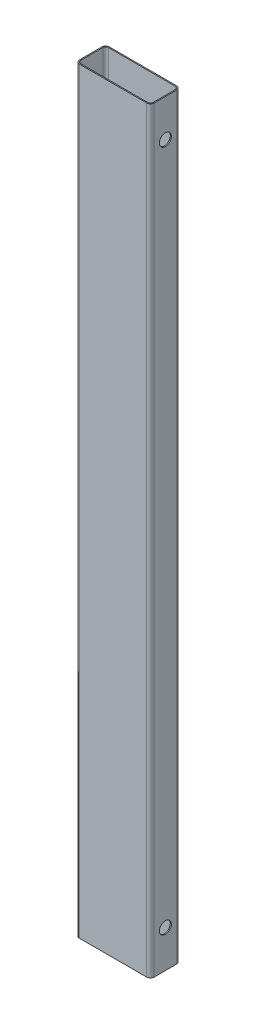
ISO-10303-21;
HEADER;
FILE_DESCRIPTION(('STEP AP214'),'2;1');
FILE_NAME('part.step','',(''),(''),'','','');
FILE_SCHEMA(('AUTOMOTIVE_DESIGN { 1 0 10303 214 1 1 1 1 }'));
ENDSEC;
DATA;
#1=APPLICATION_CONTEXT('core data for automotive mechanical design processes');
#2=APPLICATION_PROTOCOL_DEFINITION('international standard','automotive_design',2000,#1);
#3=PRODUCT_CONTEXT('',#1,'mechanical');
#4=PRODUCT('Part','Part','',(#3));
#5=PRODUCT_RELATED_PRODUCT_CATEGORY('part','',(#4));
#6=PRODUCT_DEFINITION_FORMATION('','',#4);
#7=PRODUCT_DEFINITION_CONTEXT('part definition',#1,'design');
#8=PRODUCT_DEFINITION('design','',#6,#7);
#9=PRODUCT_DEFINITION_SHAPE('','',#8);
#10=(LENGTH_UNIT() NAMED_UNIT(*) SI_UNIT(.MILLI.,.METRE.));
#11=(NAMED_UNIT(*) PLANE_ANGLE_UNIT() SI_UNIT($,.RADIAN.));
#12=(NAMED_UNIT(*) SI_UNIT($,.STERADIAN.) SOLID_ANGLE_UNIT());
#13=UNCERTAINTY_MEASURE_WITH_UNIT(LENGTH_MEASURE(1.E-05),#10,'distance_accuracy_value','');
#14=(GEOMETRIC_REPRESENTATION_CONTEXT(3) GLOBAL_UNCERTAINTY_ASSIGNED_CONTEXT((#13)) GLOBAL_UNIT_ASSIGNED_CONTEXT((#10,
#11,#12)) REPRESENTATION_CONTEXT('',''));
#15=CARTESIAN_POINT('',(0.,0.,0.));
#16=DIRECTION('',(0.,0.,1.));
#17=DIRECTION('',(1.,0.,0.));
#18=AXIS2_PLACEMENT_3D('',#15,#16,#17);
#19=CARTESIAN_POINT('',(-24.255,25.,0.));
#20=DIRECTION('',(-1.,0.,0.));
#21=DIRECTION('',(0.,-1.,0.));
#22=AXIS2_PLACEMENT_3D('',#19,#20,#21);
#23=CYLINDRICAL_SURFACE('',#22,4.);
#24=CARTESIAN_POINT('',(-24.325,25.,0.));
#25=DIRECTION('',(-1.,0.,0.));
#26=DIRECTION('',(0.,-1.,0.));
#27=AXIS2_PLACEMENT_3D('',#24,#25,#26);
#28=CIRCLE('',#27,4.);
#29=CARTESIAN_POINT('',(-24.325,21.,0.));
#30=VERTEX_POINT('',#29);
#31=EDGE_CURVE('E300',#30,#30,#28,.T.);
#32=ORIENTED_EDGE('',*,*,#31,.F.);
#33=EDGE_LOOP('',(#32));
#34=FACE_BOUND('',#33,.T.);
#35=CARTESIAN_POINT('',(-25.025,25.,0.));
#36=DIRECTION('',(-1.,0.,0.));
#37=DIRECTION('',(0.,-1.,0.));
#38=AXIS2_PLACEMENT_3D('',#35,#36,#37);
#39=CIRCLE('',#38,4.);
#40=CARTESIAN_POINT('',(-25.025,21.,0.));
#41=VERTEX_POINT('',#40);
#42=EDGE_CURVE('E21',#41,#41,#39,.T.);
#43=ORIENTED_EDGE('',*,*,#42,.T.);
#44=EDGE_LOOP('',(#43));
#45=FACE_BOUND('',#44,.T.);
#46=ADVANCED_FACE('F17',(#34,#45),#23,.F.);
#47=CARTESIAN_POINT('',(-24.255,482.,0.));
#48=DIRECTION('',(-1.,0.,0.));
#49=DIRECTION('',(0.,-1.,0.));
#50=AXIS2_PLACEMENT_3D('',#47,#48,#49);
#51=CYLINDRICAL_SURFACE('',#50,4.);
#52=CARTESIAN_POINT('',(-24.325,482.,0.));
#53=DIRECTION('',(-1.,0.,0.));
#54=DIRECTION('',(0.,-1.,0.));
#55=AXIS2_PLACEMENT_3D('',#52,#53,#54);
#56=CIRCLE('',#55,4.);
#57=CARTESIAN_POINT('',(-24.325,478.,0.));
#58=VERTEX_POINT('',#57);
#59=EDGE_CURVE('E296',#58,#58,#56,.T.);
#60=ORIENTED_EDGE('',*,*,#59,.F.);
#61=EDGE_LOOP('',(#60));
#62=FACE_BOUND('',#61,.T.);
#63=CARTESIAN_POINT('',(-25.025,482.,0.));
#64=DIRECTION('',(-1.,0.,0.));
#65=DIRECTION('',(0.,-1.,0.));
#66=AXIS2_PLACEMENT_3D('',#63,#64,#65);
#67=CIRCLE('',#66,4.);
#68=CARTESIAN_POINT('',(-25.025,478.,0.));
#69=VERTEX_POINT('',#68);
#70=EDGE_CURVE('E188',#69,#69,#67,.T.);
#71=ORIENTED_EDGE('',*,*,#70,.T.);
#72=EDGE_LOOP('',(#71));
#73=FACE_BOUND('',#72,.T.);
#74=ADVANCED_FACE('F705',(#62,#73),#51,.F.);
#75=CARTESIAN_POINT('',(7.50000000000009,447.,-9.255));
#76=DIRECTION('',(0.,0.,-1.));
#77=DIRECTION('',(0.,1.,0.));
#78=AXIS2_PLACEMENT_3D('',#75,#76,#77);
#79=CYLINDRICAL_SURFACE('',#78,4.99999999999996);
#80=DIRECTION('',(0.,0.,-1.));
#81=VECTOR('',#80,1.);
#82=CARTESIAN_POINT('',(12.5,447.,-9.675));
#83=LINE('',#82,#81);
#84=CARTESIAN_POINT('',(12.49999999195,447.,-9.325));
#85=VERTEX_POINT('',#84);
#86=CARTESIAN_POINT('',(12.49999999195,447.,-10.025));
#87=VERTEX_POINT('',#86);
#88=EDGE_CURVE('E198',#85,#87,#83,.T.);
#89=ORIENTED_EDGE('',*,*,#88,.T.);
#90=CARTESIAN_POINT('',(7.5000000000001,447.,-10.025));
#91=DIRECTION('',(0.,0.,-1.));
#92=DIRECTION('',(0.,1.,0.));
#93=AXIS2_PLACEMENT_3D('',#90,#91,#92);
#94=CIRCLE('',#93,4.99999999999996);
#95=CARTESIAN_POINT('',(7.50000000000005,442.000000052,-10.025));
#96=VERTEX_POINT('',#95);
#97=EDGE_CURVE('E304',#87,#96,#94,.T.);
#98=ORIENTED_EDGE('',*,*,#97,.T.);
#99=DIRECTION('',(0.,0.,1.));
#100=VECTOR('',#99,1.);
#101=CARTESIAN_POINT('',(7.5,442.,-9.675));
#102=LINE('',#101,#100);
#103=CARTESIAN_POINT('',(7.50000000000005,442.000000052,-9.325));
#104=VERTEX_POINT('',#103);
#105=EDGE_CURVE('E214',#96,#104,#102,.T.);
#106=ORIENTED_EDGE('',*,*,#105,.T.);
#107=CARTESIAN_POINT('',(7.50000000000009,447.,-9.325));
#108=DIRECTION('',(0.,0.,-1.));
#109=DIRECTION('',(0.,1.,0.));
#110=AXIS2_PLACEMENT_3D('',#107,#108,#109);
#111=CIRCLE('',#110,4.99999999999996);
#112=EDGE_CURVE('E293',#85,#104,#111,.T.);
#113=ORIENTED_EDGE('',*,*,#112,.F.);
#114=EDGE_LOOP('',(#89,#98,#106,#113));
#115=FACE_BOUND('',#114,.T.);
#116=ADVANCED_FACE('F355',(#115),#79,.F.);
#117=CARTESIAN_POINT('',(-7.5,442.,-9.325));
#118=DIRECTION('',(0.,-1.,0.));
#119=DIRECTION('',(0.,0.,-1.));
#120=AXIS2_PLACEMENT_3D('',#117,#118,#119);
#121=PLANE('',#120);
#122=ORIENTED_EDGE('',*,*,#105,.F.);
#123=DIRECTION('',(-1.,0.,0.));
#124=VECTOR('',#123,1.);
#125=CARTESIAN_POINT('',(0.,442.000000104,-10.025));
#126=LINE('',#125,#124);
#127=CARTESIAN_POINT('',(-7.50000000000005,442.000000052,-10.025));
#128=VERTEX_POINT('',#127);
#129=EDGE_CURVE('E306',#96,#128,#126,.T.);
#130=ORIENTED_EDGE('',*,*,#129,.T.);
#131=DIRECTION('',(0.,0.,1.));
#132=VECTOR('',#131,1.);
#133=CARTESIAN_POINT('',(-7.5,442.,-9.675));
#134=LINE('',#133,#132);
#135=CARTESIAN_POINT('',(-7.50000000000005,442.000000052,-9.325));
#136=VERTEX_POINT('',#135);
#137=EDGE_CURVE('E153',#128,#136,#134,.T.);
#138=ORIENTED_EDGE('',*,*,#137,.T.);
#139=DIRECTION('',(-1.,0.,0.));
#140=VECTOR('',#139,1.);
#141=CARTESIAN_POINT('',(0.,442.000000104,-9.325));
#142=LINE('',#141,#140);
#143=EDGE_CURVE('E292',#104,#136,#142,.T.);
#144=ORIENTED_EDGE('',*,*,#143,.F.);
#145=EDGE_LOOP('',(#122,#130,#138,#144));
#146=FACE_BOUND('',#145,.T.);
#147=ADVANCED_FACE('F351',(#146),#121,.F.);
#148=CARTESIAN_POINT('',(-7.50000000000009,447.,-9.255));
#149=DIRECTION('',(0.,0.,-1.));
#150=DIRECTION('',(0.,1.,0.));
#151=AXIS2_PLACEMENT_3D('',#148,#149,#150);
#152=CYLINDRICAL_SURFACE('',#151,4.99999999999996);
#153=ORIENTED_EDGE('',*,*,#137,.F.);
#154=CARTESIAN_POINT('',(-7.5000000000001,447.,-10.025));
#155=DIRECTION('',(0.,0.,-1.));
#156=DIRECTION('',(0.,1.,0.));
#157=AXIS2_PLACEMENT_3D('',#154,#155,#156);
#158=CIRCLE('',#157,4.99999999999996);
#159=CARTESIAN_POINT('',(-12.49999999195,447.,-10.025));
#160=VERTEX_POINT('',#159);
#161=EDGE_CURVE('E174',#128,#160,#158,.T.);
#162=ORIENTED_EDGE('',*,*,#161,.T.);
#163=DIRECTION('',(0.,0.,1.));
#164=VECTOR('',#163,1.);
#165=CARTESIAN_POINT('',(-12.5,447.,-9.675));
#166=LINE('',#165,#164);
#167=CARTESIAN_POINT('',(-12.49999999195,447.,-9.325));
#168=VERTEX_POINT('',#167);
#169=EDGE_CURVE('E160',#160,#168,#166,.T.);
#170=ORIENTED_EDGE('',*,*,#169,.T.);
#171=CARTESIAN_POINT('',(-7.50000000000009,447.,-9.325));
#172=DIRECTION('',(0.,0.,-1.));
#173=DIRECTION('',(0.,1.,0.));
#174=AXIS2_PLACEMENT_3D('',#171,#172,#173);
#175=CIRCLE('',#174,4.99999999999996);
#176=EDGE_CURVE('E290',#136,#168,#175,.T.);
#177=ORIENTED_EDGE('',*,*,#176,.F.);
#178=EDGE_LOOP('',(#153,#162,#170,#177));
#179=FACE_BOUND('',#178,.T.);
#180=ADVANCED_FACE('F180',(#179),#152,.F.);
#181=CARTESIAN_POINT('',(-12.5,447.,-10.025));
#182=DIRECTION('',(-1.,0.,0.));
#183=DIRECTION('',(0.,0.,1.));
#184=AXIS2_PLACEMENT_3D('',#181,#182,#183);
#185=PLANE('',#184);
#186=ORIENTED_EDGE('',*,*,#169,.F.);
#187=DIRECTION('',(0.,1.,0.));
#188=VECTOR('',#187,1.);
#189=CARTESIAN_POINT('',(-12.4999999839,253.5,-10.025));
#190=LINE('',#189,#188);
#191=CARTESIAN_POINT('',(-12.49999999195,462.,-10.025));
#192=VERTEX_POINT('',#191);
#193=EDGE_CURVE('E164',#160,#192,#190,.T.);
#194=ORIENTED_EDGE('',*,*,#193,.T.);
#195=DIRECTION('',(0.,0.,1.));
#196=VECTOR('',#195,1.);
#197=CARTESIAN_POINT('',(-12.5,462.,-9.675));
#198=LINE('',#197,#196);
#199=CARTESIAN_POINT('',(-12.49999999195,462.,-9.325));
#200=VERTEX_POINT('',#199);
#201=EDGE_CURVE('E166',#192,#200,#198,.T.);
#202=ORIENTED_EDGE('',*,*,#201,.T.);
#203=DIRECTION('',(0.,1.,0.));
#204=VECTOR('',#203,1.);
#205=CARTESIAN_POINT('',(-12.4999999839,253.5,-9.325));
#206=LINE('',#205,#204);
#207=EDGE_CURVE('E165',#168,#200,#206,.T.);
#208=ORIENTED_EDGE('',*,*,#207,.F.);
#209=EDGE_LOOP('',(#186,#194,#202,#208));
#210=FACE_BOUND('',#209,.T.);
#211=ADVANCED_FACE('F162',(#210),#185,.F.);
#212=CARTESIAN_POINT('',(-7.5,462.,-9.255));
#213=DIRECTION('',(0.,0.,-1.));
#214=DIRECTION('',(0.,1.,0.));
#215=AXIS2_PLACEMENT_3D('',#212,#213,#214);
#216=CYLINDRICAL_SURFACE('',#215,5.);
#217=ORIENTED_EDGE('',*,*,#201,.F.);
#218=CARTESIAN_POINT('',(-7.5,462.,-10.025));
#219=DIRECTION('',(0.,0.,-1.));
#220=DIRECTION('',(0.,1.,0.));
#221=AXIS2_PLACEMENT_3D('',#218,#219,#220);
#222=CIRCLE('',#221,5.);
#223=CARTESIAN_POINT('',(-7.5,466.999999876,-10.025));
#224=VERTEX_POINT('',#223);
#225=EDGE_CURVE('E178',#192,#224,#222,.T.);
#226=ORIENTED_EDGE('',*,*,#225,.T.);
#227=DIRECTION('',(0.,0.,1.));
#228=VECTOR('',#227,1.);
#229=CARTESIAN_POINT('',(-7.5,467.,-9.675));
#230=LINE('',#229,#228);
#231=CARTESIAN_POINT('',(-7.5,466.999999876,-9.325));
#232=VERTEX_POINT('',#231);
#233=EDGE_CURVE('E209',#224,#232,#230,.T.);
#234=ORIENTED_EDGE('',*,*,#233,.T.);
#235=CARTESIAN_POINT('',(-7.5,462.,-9.325));
#236=DIRECTION('',(0.,0.,-1.));
#237=DIRECTION('',(0.,1.,0.));
#238=AXIS2_PLACEMENT_3D('',#235,#236,#237);
#239=CIRCLE('',#238,5.);
#240=EDGE_CURVE('E288',#200,#232,#239,.T.);
#241=ORIENTED_EDGE('',*,*,#240,.F.);
#242=EDGE_LOOP('',(#217,#226,#234,#241));
#243=FACE_BOUND('',#242,.T.);
#244=ADVANCED_FACE('F364',(#243),#216,.F.);
#245=CARTESIAN_POINT('',(7.5,467.,-10.025));
#246=DIRECTION('',(0.,1.,0.));
#247=DIRECTION('',(-1.,0.,0.));
#248=AXIS2_PLACEMENT_3D('',#245,#246,#247);
#249=PLANE('',#248);
#250=ORIENTED_EDGE('',*,*,#233,.F.);
#251=DIRECTION('',(1.,0.,0.));
#252=VECTOR('',#251,1.);
#253=CARTESIAN_POINT('',(0.,466.999999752,-10.025));
#254=LINE('',#253,#252);
#255=CARTESIAN_POINT('',(7.5,466.999999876,-10.025));
#256=VERTEX_POINT('',#255);
#257=EDGE_CURVE('E309',#224,#256,#254,.T.);
#258=ORIENTED_EDGE('',*,*,#257,.T.);
#259=DIRECTION('',(0.,0.,1.));
#260=VECTOR('',#259,1.);
#261=CARTESIAN_POINT('',(7.5,467.,-9.675));
#262=LINE('',#261,#260);
#263=CARTESIAN_POINT('',(7.5,466.999999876,-9.325));
#264=VERTEX_POINT('',#263);
#265=EDGE_CURVE('E204',#256,#264,#262,.T.);
#266=ORIENTED_EDGE('',*,*,#265,.T.);
#267=DIRECTION('',(1.,0.,0.));
#268=VECTOR('',#267,1.);
#269=CARTESIAN_POINT('',(0.,466.999999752,-9.325));
#270=LINE('',#269,#268);
#271=EDGE_CURVE('E287',#232,#264,#270,.T.);
#272=ORIENTED_EDGE('',*,*,#271,.F.);
#273=EDGE_LOOP('',(#250,#258,#266,#272));
#274=FACE_BOUND('',#273,.T.);
#275=ADVANCED_FACE('F366',(#274),#249,.F.);
#276=CARTESIAN_POINT('',(7.5,462.,-9.255));
#277=DIRECTION('',(0.,0.,-1.));
#278=DIRECTION('',(0.,1.,0.));
#279=AXIS2_PLACEMENT_3D('',#276,#277,#278);
#280=CYLINDRICAL_SURFACE('',#279,5.);
#281=ORIENTED_EDGE('',*,*,#265,.F.);
#282=CARTESIAN_POINT('',(7.5,462.,-10.025));
#283=DIRECTION('',(0.,0.,-1.));
#284=DIRECTION('',(0.,1.,0.));
#285=AXIS2_PLACEMENT_3D('',#282,#283,#284);
#286=CIRCLE('',#285,5.);
#287=CARTESIAN_POINT('',(12.49999999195,462.,-10.025));
#288=VERTEX_POINT('',#287);
#289=EDGE_CURVE('E308',#256,#288,#286,.T.);
#290=ORIENTED_EDGE('',*,*,#289,.T.);
#291=DIRECTION('',(0.,0.,1.));
#292=VECTOR('',#291,1.);
#293=CARTESIAN_POINT('',(12.5,462.,-9.675));
#294=LINE('',#293,#292);
#295=CARTESIAN_POINT('',(12.49999999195,462.,-9.325));
#296=VERTEX_POINT('',#295);
#297=EDGE_CURVE('E194',#288,#296,#294,.T.);
#298=ORIENTED_EDGE('',*,*,#297,.T.);
#299=CARTESIAN_POINT('',(7.5,462.,-9.325));
#300=DIRECTION('',(0.,0.,-1.));
#301=DIRECTION('',(0.,1.,0.));
#302=AXIS2_PLACEMENT_3D('',#299,#300,#301);
#303=CIRCLE('',#302,5.);
#304=EDGE_CURVE('E284',#264,#296,#303,.T.);
#305=ORIENTED_EDGE('',*,*,#304,.F.);
#306=EDGE_LOOP('',(#281,#290,#298,#305));
#307=FACE_BOUND('',#306,.T.);
#308=ADVANCED_FACE('F362',(#307),#280,.F.);
#309=CARTESIAN_POINT('',(12.5,447.,-10.025));
#310=DIRECTION('',(1.,0.,0.));
#311=DIRECTION('',(0.,1.,0.));
#312=AXIS2_PLACEMENT_3D('',#309,#310,#311);
#313=PLANE('',#312);
#314=ORIENTED_EDGE('',*,*,#297,.F.);
#315=DIRECTION('',(0.,-1.,0.));
#316=VECTOR('',#315,1.);
#317=CARTESIAN_POINT('',(12.4999999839,253.5,-10.025));
#318=LINE('',#317,#316);
#319=EDGE_CURVE('E307',#288,#87,#318,.T.);
#320=ORIENTED_EDGE('',*,*,#319,.T.);
#321=ORIENTED_EDGE('',*,*,#88,.F.);
#322=DIRECTION('',(0.,-1.,0.));
#323=VECTOR('',#322,1.);
#324=CARTESIAN_POINT('',(12.4999999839,253.5,-9.325));
#325=LINE('',#324,#323);
#326=EDGE_CURVE('E286',#296,#85,#325,.T.);
#327=ORIENTED_EDGE('',*,*,#326,.F.);
#328=EDGE_LOOP('',(#314,#320,#321,#327));
#329=FACE_BOUND('',#328,.T.);
#330=ADVANCED_FACE('F358',(#329),#313,.F.);
#331=CARTESIAN_POINT('',(-25.025,0.,7.525));
#332=DIRECTION('',(1.,0.,0.));
#333=DIRECTION('',(0.,0.,-1.));
#334=AXIS2_PLACEMENT_3D('',#331,#332,#333);
#335=PLANE('',#334);
#336=ORIENTED_EDGE('',*,*,#70,.F.);
#337=EDGE_LOOP('',(#336));
#338=FACE_BOUND('',#337,.T.);
#339=ORIENTED_EDGE('',*,*,#42,.F.);
#340=EDGE_LOOP('',(#339));
#341=FACE_BOUND('',#340,.T.);
#342=DIRECTION('',(0.,-1.,0.));
#343=VECTOR('',#342,1.);
#344=CARTESIAN_POINT('',(-25.025,253.5,7.525));
#345=LINE('',#344,#343);
#346=CARTESIAN_POINT('',(-25.025,507.,7.525));
#347=VERTEX_POINT('',#346);
#348=CARTESIAN_POINT('',(-25.025,0.,7.525));
#349=VERTEX_POINT('',#348);
#350=EDGE_CURVE('E184',#347,#349,#345,.T.);
#351=ORIENTED_EDGE('',*,*,#350,.F.);
#352=DIRECTION('',(0.,0.,1.));
#353=VECTOR('',#352,1.);
#354=CARTESIAN_POINT('',(-25.025,507.,0.));
#355=LINE('',#354,#353);
#356=CARTESIAN_POINT('',(-25.025,507.,-7.525));
#357=VERTEX_POINT('',#356);
#358=EDGE_CURVE('E279',#357,#347,#355,.T.);
#359=ORIENTED_EDGE('',*,*,#358,.F.);
#360=DIRECTION('',(0.,1.,0.));
#361=VECTOR('',#360,1.);
#362=CARTESIAN_POINT('',(-25.025,253.5,-7.525));
#363=LINE('',#362,#361);
#364=CARTESIAN_POINT('',(-25.025,0.,-7.525));
#365=VERTEX_POINT('',#364);
#366=EDGE_CURVE('E349',#365,#357,#363,.T.);
#367=ORIENTED_EDGE('',*,*,#366,.F.);
#368=DIRECTION('',(0.,0.,1.));
#369=VECTOR('',#368,1.);
#370=CARTESIAN_POINT('',(-25.025,0.,0.));
#371=LINE('',#370,#369);
#372=EDGE_CURVE('E256',#365,#349,#371,.T.);
#373=ORIENTED_EDGE('',*,*,#372,.T.);
#374=EDGE_LOOP('',(#351,#359,#367,#373));
#375=FACE_BOUND('',#374,.T.);
#376=ADVANCED_FACE('F451',(#338,#341,#375),#335,.F.);
#377=CARTESIAN_POINT('',(-22.525,507.,7.52499999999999));
#378=DIRECTION('',(0.,-1.,0.));
#379=DIRECTION('',(0.,0.,-1.));
#380=AXIS2_PLACEMENT_3D('',#377,#378,#379);
#381=CYLINDRICAL_SURFACE('',#380,2.5);
#382=CARTESIAN_POINT('',(-22.525,507.,7.52499999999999));
#383=DIRECTION('',(0.,-1.,0.));
#384=DIRECTION('',(0.,0.,-1.));
#385=AXIS2_PLACEMENT_3D('',#382,#383,#384);
#386=CIRCLE('',#385,2.5);
#387=CARTESIAN_POINT('',(-22.525,507.,10.025));
#388=VERTEX_POINT('',#387);
#389=EDGE_CURVE('E277',#347,#388,#386,.F.);
#390=ORIENTED_EDGE('',*,*,#389,.F.);
#391=ORIENTED_EDGE('',*,*,#350,.T.);
#392=CARTESIAN_POINT('',(-22.525,0.,7.52499999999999));
#393=DIRECTION('',(0.,-1.,0.));
#394=DIRECTION('',(0.,0.,-1.));
#395=AXIS2_PLACEMENT_3D('',#392,#393,#394);
#396=CIRCLE('',#395,2.5);
#397=CARTESIAN_POINT('',(-22.525,0.,10.025));
#398=VERTEX_POINT('',#397);
#399=EDGE_CURVE('E253',#349,#398,#396,.F.);
#400=ORIENTED_EDGE('',*,*,#399,.T.);
#401=DIRECTION('',(0.,1.,0.));
#402=VECTOR('',#401,1.);
#403=CARTESIAN_POINT('',(-22.525,253.5,10.025));
#404=LINE('',#403,#402);
#405=EDGE_CURVE('E181',#398,#388,#404,.T.);
#406=ORIENTED_EDGE('',*,*,#405,.T.);
#407=EDGE_LOOP('',(#390,#391,#400,#406));
#408=FACE_BOUND('',#407,.T.);
#409=ADVANCED_FACE('F455',(#408),#381,.T.);
#410=CARTESIAN_POINT('',(22.525,0.,10.025));
#411=DIRECTION('',(0.,0.,-1.));
#412=DIRECTION('',(-1.,0.,0.));
#413=AXIS2_PLACEMENT_3D('',#410,#411,#412);
#414=PLANE('',#413);
#415=DIRECTION('',(0.,-1.,0.));
#416=VECTOR('',#415,1.);
#417=CARTESIAN_POINT('',(22.525,253.5,10.025));
#418=LINE('',#417,#416);
#419=CARTESIAN_POINT('',(22.525,507.,10.025));
#420=VERTEX_POINT('',#419);
#421=CARTESIAN_POINT('',(22.525,0.,10.025));
#422=VERTEX_POINT('',#421);
#423=EDGE_CURVE('E283',#420,#422,#418,.T.);
#424=ORIENTED_EDGE('',*,*,#423,.F.);
#425=DIRECTION('',(1.,0.,0.));
#426=VECTOR('',#425,1.);
#427=CARTESIAN_POINT('',(0.,507.,10.025));
#428=LINE('',#427,#426);
#429=EDGE_CURVE('E276',#388,#420,#428,.T.);
#430=ORIENTED_EDGE('',*,*,#429,.F.);
#431=ORIENTED_EDGE('',*,*,#405,.F.);
#432=DIRECTION('',(1.,0.,0.));
#433=VECTOR('',#432,1.);
#434=CARTESIAN_POINT('',(0.,0.,10.025));
#435=LINE('',#434,#433);
#436=EDGE_CURVE('E252',#398,#422,#435,.T.);
#437=ORIENTED_EDGE('',*,*,#436,.T.);
#438=EDGE_LOOP('',(#424,#430,#431,#437));
#439=FACE_BOUND('',#438,.T.);
#440=ADVANCED_FACE('F460',(#439),#414,.F.);
#441=CARTESIAN_POINT('',(-22.525,0.,-10.025));
#442=DIRECTION('',(0.,0.,1.));
#443=DIRECTION('',(1.,0.,0.));
#444=AXIS2_PLACEMENT_3D('',#441,#442,#443);
#445=PLANE('',#444);
#446=ORIENTED_EDGE('',*,*,#97,.F.);
#447=ORIENTED_EDGE('',*,*,#319,.F.);
#448=ORIENTED_EDGE('',*,*,#289,.F.);
#449=ORIENTED_EDGE('',*,*,#257,.F.);
#450=ORIENTED_EDGE('',*,*,#225,.F.);
#451=ORIENTED_EDGE('',*,*,#193,.F.);
#452=ORIENTED_EDGE('',*,*,#161,.F.);
#453=ORIENTED_EDGE('',*,*,#129,.F.);
#454=EDGE_LOOP('',(#446,#447,#448,#449,#450,#451,#452,#453));
#455=FACE_BOUND('',#454,.T.);
#456=DIRECTION('',(0.,-1.,0.));
#457=VECTOR('',#456,1.);
#458=CARTESIAN_POINT('',(-22.525,253.5,-10.025));
#459=LINE('',#458,#457);
#460=CARTESIAN_POINT('',(-22.525,507.,-10.025));
#461=VERTEX_POINT('',#460);
#462=CARTESIAN_POINT('',(-22.525,0.,-10.025));
#463=VERTEX_POINT('',#462);
#464=EDGE_CURVE('E303',#461,#463,#459,.T.);
#465=ORIENTED_EDGE('',*,*,#464,.F.);
#466=DIRECTION('',(-1.,0.,0.));
#467=VECTOR('',#466,1.);
#468=CARTESIAN_POINT('',(0.,507.,-10.025));
#469=LINE('',#468,#467);
#470=CARTESIAN_POINT('',(22.525,507.,-10.025));
#471=VERTEX_POINT('',#470);
#472=EDGE_CURVE('E275',#471,#461,#469,.T.);
#473=ORIENTED_EDGE('',*,*,#472,.F.);
#474=DIRECTION('',(0.,1.,0.));
#475=VECTOR('',#474,1.);
#476=CARTESIAN_POINT('',(22.525,253.5,-10.025));
#477=LINE('',#476,#475);
#478=CARTESIAN_POINT('',(22.525,0.,-10.025));
#479=VERTEX_POINT('',#478);
#480=EDGE_CURVE('E259',#479,#471,#477,.T.);
#481=ORIENTED_EDGE('',*,*,#480,.F.);
#482=DIRECTION('',(-1.,0.,0.));
#483=VECTOR('',#482,1.);
#484=CARTESIAN_POINT('',(0.,0.,-10.025));
#485=LINE('',#484,#483);
#486=EDGE_CURVE('E247',#479,#463,#485,.T.);
#487=ORIENTED_EDGE('',*,*,#486,.T.);
#488=EDGE_LOOP('',(#465,#473,#481,#487));
#489=FACE_BOUND('',#488,.T.);
#490=ADVANCED_FACE('F171',(#455,#489),#445,.F.);
#491=CARTESIAN_POINT('',(-22.525,507.,-7.52499999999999));
#492=DIRECTION('',(0.,-1.,0.));
#493=DIRECTION('',(0.,0.,-1.));
#494=AXIS2_PLACEMENT_3D('',#491,#492,#493);
#495=CYLINDRICAL_SURFACE('',#494,2.5);
#496=CARTESIAN_POINT('',(-22.525,507.,-7.52499999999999));
#497=DIRECTION('',(0.,-1.,0.));
#498=DIRECTION('',(0.,0.,-1.));
#499=AXIS2_PLACEMENT_3D('',#496,#497,#498);
#500=CIRCLE('',#499,2.5);
#501=EDGE_CURVE('E280',#461,#357,#500,.F.);
#502=ORIENTED_EDGE('',*,*,#501,.F.);
#503=ORIENTED_EDGE('',*,*,#464,.T.);
#504=CARTESIAN_POINT('',(-22.525,0.,-7.52499999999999));
#505=DIRECTION('',(0.,-1.,0.));
#506=DIRECTION('',(0.,0.,-1.));
#507=AXIS2_PLACEMENT_3D('',#504,#505,#506);
#508=CIRCLE('',#507,2.5);
#509=EDGE_CURVE('E244',#463,#365,#508,.F.);
#510=ORIENTED_EDGE('',*,*,#509,.T.);
#511=ORIENTED_EDGE('',*,*,#366,.T.);
#512=EDGE_LOOP('',(#502,#503,#510,#511));
#513=FACE_BOUND('',#512,.T.);
#514=ADVANCED_FACE('F499',(#513),#495,.T.);
#515=CARTESIAN_POINT('',(-24.325,0.,7.525));
#516=DIRECTION('',(1.,0.,0.));
#517=DIRECTION('',(0.,0.,-1.));
#518=AXIS2_PLACEMENT_3D('',#515,#516,#517);
#519=PLANE('',#518);
#520=ORIENTED_EDGE('',*,*,#59,.T.);
#521=EDGE_LOOP('',(#520));
#522=FACE_BOUND('',#521,.T.);
#523=ORIENTED_EDGE('',*,*,#31,.T.);
#524=EDGE_LOOP('',(#523));
#525=FACE_BOUND('',#524,.T.);
#526=DIRECTION('',(0.,0.,-1.));
#527=VECTOR('',#526,1.);
#528=CARTESIAN_POINT('',(-24.3249999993,507.,0.));
#529=LINE('',#528,#527);
#530=CARTESIAN_POINT('',(-24.32499999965,507.,7.525));
#531=VERTEX_POINT('',#530);
#532=CARTESIAN_POINT('',(-24.32499999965,507.,-7.525));
#533=VERTEX_POINT('',#532);
#534=EDGE_CURVE('E268',#531,#533,#529,.T.);
#535=ORIENTED_EDGE('',*,*,#534,.F.);
#536=DIRECTION('',(0.,-1.,0.));
#537=VECTOR('',#536,1.);
#538=CARTESIAN_POINT('',(-24.325,253.5,7.525));
#539=LINE('',#538,#537);
#540=CARTESIAN_POINT('',(-24.32499999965,0.,7.525));
#541=VERTEX_POINT('',#540);
#542=EDGE_CURVE('E333',#531,#541,#539,.T.);
#543=ORIENTED_EDGE('',*,*,#542,.T.);
#544=DIRECTION('',(0.,0.,-1.));
#545=VECTOR('',#544,1.);
#546=CARTESIAN_POINT('',(-24.3249999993,0.,0.));
#547=LINE('',#546,#545);
#548=CARTESIAN_POINT('',(-24.32499999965,0.,-7.525));
#549=VERTEX_POINT('',#548);
#550=EDGE_CURVE('E243',#541,#549,#547,.T.);
#551=ORIENTED_EDGE('',*,*,#550,.T.);
#552=DIRECTION('',(0.,1.,0.));
#553=VECTOR('',#552,1.);
#554=CARTESIAN_POINT('',(-24.325,253.5,-7.525));
#555=LINE('',#554,#553);
#556=EDGE_CURVE('E299',#549,#533,#555,.T.);
#557=ORIENTED_EDGE('',*,*,#556,.T.);
#558=EDGE_LOOP('',(#535,#543,#551,#557));
#559=FACE_BOUND('',#558,.T.);
#560=ADVANCED_FACE('F430',(#522,#525,#559),#519,.T.);
#561=CARTESIAN_POINT('',(-22.525,507.,-7.52499999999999));
#562=DIRECTION('',(0.,-1.,0.));
#563=DIRECTION('',(0.,0.,-1.));
#564=AXIS2_PLACEMENT_3D('',#561,#562,#563);
#565=CYLINDRICAL_SURFACE('',#564,1.80000000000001);
#566=DIRECTION('',(0.,-1.,0.));
#567=VECTOR('',#566,1.);
#568=CARTESIAN_POINT('',(-22.525,253.5,-9.325));
#569=LINE('',#568,#567);
#570=CARTESIAN_POINT('',(-22.525,507.,-9.32500000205));
#571=VERTEX_POINT('',#570);
#572=CARTESIAN_POINT('',(-22.525,0.,-9.32500000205));
#573=VERTEX_POINT('',#572);
#574=EDGE_CURVE('E295',#571,#573,#569,.T.);
#575=ORIENTED_EDGE('',*,*,#574,.F.);
#576=CARTESIAN_POINT('',(-22.525,507.,-7.52499999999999));
#577=DIRECTION('',(0.,-1.,0.));
#578=DIRECTION('',(0.,0.,-1.));
#579=AXIS2_PLACEMENT_3D('',#576,#577,#578);
#580=CIRCLE('',#579,1.80000000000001);
#581=EDGE_CURVE('E266',#533,#571,#580,.T.);
#582=ORIENTED_EDGE('',*,*,#581,.F.);
#583=ORIENTED_EDGE('',*,*,#556,.F.);
#584=CARTESIAN_POINT('',(-22.525,0.,-7.52499999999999));
#585=DIRECTION('',(0.,-1.,0.));
#586=DIRECTION('',(0.,0.,-1.));
#587=AXIS2_PLACEMENT_3D('',#584,#585,#586);
#588=CIRCLE('',#587,1.80000000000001);
#589=EDGE_CURVE('E240',#549,#573,#588,.T.);
#590=ORIENTED_EDGE('',*,*,#589,.T.);
#591=EDGE_LOOP('',(#575,#582,#583,#590));
#592=FACE_BOUND('',#591,.T.);
#593=ADVANCED_FACE('F493',(#592),#565,.F.);
#594=CARTESIAN_POINT('',(-22.525,0.,-9.325));
#595=DIRECTION('',(0.,0.,1.));
#596=DIRECTION('',(1.,0.,0.));
#597=AXIS2_PLACEMENT_3D('',#594,#595,#596);
#598=PLANE('',#597);
#599=ORIENTED_EDGE('',*,*,#304,.T.);
#600=ORIENTED_EDGE('',*,*,#326,.T.);
#601=ORIENTED_EDGE('',*,*,#112,.T.);
#602=ORIENTED_EDGE('',*,*,#143,.T.);
#603=ORIENTED_EDGE('',*,*,#176,.T.);
#604=ORIENTED_EDGE('',*,*,#207,.T.);
#605=ORIENTED_EDGE('',*,*,#240,.T.);
#606=ORIENTED_EDGE('',*,*,#271,.T.);
#607=EDGE_LOOP('',(#599,#600,#601,#602,#603,#604,#605,#606));
#608=FACE_BOUND('',#607,.T.);
#609=DIRECTION('',(1.,0.,0.));
#610=VECTOR('',#609,1.);
#611=CARTESIAN_POINT('',(0.,507.,-9.3250000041));
#612=LINE('',#611,#610);
#613=CARTESIAN_POINT('',(22.525,507.,-9.32500000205));
#614=VERTEX_POINT('',#613);
#615=EDGE_CURVE('E265',#571,#614,#612,.T.);
#616=ORIENTED_EDGE('',*,*,#615,.F.);
#617=ORIENTED_EDGE('',*,*,#574,.T.);
#618=DIRECTION('',(1.,0.,0.));
#619=VECTOR('',#618,1.);
#620=CARTESIAN_POINT('',(0.,0.,-9.3250000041));
#621=LINE('',#620,#619);
#622=CARTESIAN_POINT('',(22.525,0.,-9.32500000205));
#623=VERTEX_POINT('',#622);
#624=EDGE_CURVE('E239',#573,#623,#621,.T.);
#625=ORIENTED_EDGE('',*,*,#624,.T.);
#626=DIRECTION('',(0.,1.,0.));
#627=VECTOR('',#626,1.);
#628=CARTESIAN_POINT('',(22.525,253.5,-9.325));
#629=LINE('',#628,#627);
#630=EDGE_CURVE('E319',#623,#614,#629,.T.);
#631=ORIENTED_EDGE('',*,*,#630,.T.);
#632=EDGE_LOOP('',(#616,#617,#625,#631));
#633=FACE_BOUND('',#632,.T.);
#634=ADVANCED_FACE('F360',(#608,#633),#598,.T.);
#635=CARTESIAN_POINT('',(22.525,0.,9.325));
#636=DIRECTION('',(0.,0.,-1.));
#637=DIRECTION('',(-1.,0.,0.));
#638=AXIS2_PLACEMENT_3D('',#635,#636,#637);
#639=PLANE('',#638);
#640=DIRECTION('',(-1.,0.,0.));
#641=VECTOR('',#640,1.);
#642=CARTESIAN_POINT('',(0.,507.,9.3250000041));
#643=LINE('',#642,#641);
#644=CARTESIAN_POINT('',(22.525,507.,9.32500000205));
#645=VERTEX_POINT('',#644);
#646=CARTESIAN_POINT('',(-22.525,507.,9.32500000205));
#647=VERTEX_POINT('',#646);
#648=EDGE_CURVE('E272',#645,#647,#643,.T.);
#649=ORIENTED_EDGE('',*,*,#648,.F.);
#650=DIRECTION('',(0.,-1.,0.));
#651=VECTOR('',#650,1.);
#652=CARTESIAN_POINT('',(22.525,253.5,9.325));
#653=LINE('',#652,#651);
#654=CARTESIAN_POINT('',(22.525,0.,9.32500000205));
#655=VERTEX_POINT('',#654);
#656=EDGE_CURVE('E325',#645,#655,#653,.T.);
#657=ORIENTED_EDGE('',*,*,#656,.T.);
#658=DIRECTION('',(-1.,0.,0.));
#659=VECTOR('',#658,1.);
#660=CARTESIAN_POINT('',(0.,0.,9.3250000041));
#661=LINE('',#660,#659);
#662=CARTESIAN_POINT('',(-22.525,0.,9.32500000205));
#663=VERTEX_POINT('',#662);
#664=EDGE_CURVE('E232',#655,#663,#661,.T.);
#665=ORIENTED_EDGE('',*,*,#664,.T.);
#666=DIRECTION('',(0.,1.,0.));
#667=VECTOR('',#666,1.);
#668=CARTESIAN_POINT('',(-22.525,253.5,9.325));
#669=LINE('',#668,#667);
#670=EDGE_CURVE('E339',#663,#647,#669,.T.);
#671=ORIENTED_EDGE('',*,*,#670,.T.);
#672=EDGE_LOOP('',(#649,#657,#665,#671));
#673=FACE_BOUND('',#672,.T.);
#674=ADVANCED_FACE('F420',(#673),#639,.T.);
#675=CARTESIAN_POINT('',(-22.525,507.,7.52499999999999));
#676=DIRECTION('',(0.,-1.,0.));
#677=DIRECTION('',(0.,0.,-1.));
#678=AXIS2_PLACEMENT_3D('',#675,#676,#677);
#679=CYLINDRICAL_SURFACE('',#678,1.80000000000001);
#680=ORIENTED_EDGE('',*,*,#542,.F.);
#681=CARTESIAN_POINT('',(-22.525,507.,7.52499999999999));
#682=DIRECTION('',(0.,-1.,0.));
#683=DIRECTION('',(0.,0.,-1.));
#684=AXIS2_PLACEMENT_3D('',#681,#682,#683);
#685=CIRCLE('',#684,1.80000000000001);
#686=EDGE_CURVE('E269',#647,#531,#685,.T.);
#687=ORIENTED_EDGE('',*,*,#686,.F.);
#688=ORIENTED_EDGE('',*,*,#670,.F.);
#689=CARTESIAN_POINT('',(-22.525,0.,7.52499999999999));
#690=DIRECTION('',(0.,-1.,0.));
#691=DIRECTION('',(0.,0.,-1.));
#692=AXIS2_PLACEMENT_3D('',#689,#690,#691);
#693=CIRCLE('',#692,1.80000000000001);
#694=EDGE_CURVE('E228',#663,#541,#693,.T.);
#695=ORIENTED_EDGE('',*,*,#694,.T.);
#696=EDGE_LOOP('',(#680,#687,#688,#695));
#697=FACE_BOUND('',#696,.T.);
#698=ADVANCED_FACE('F425',(#697),#679,.F.);
#699=CARTESIAN_POINT('',(22.525,507.,7.52499999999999));
#700=DIRECTION('',(0.,-1.,0.));
#701=DIRECTION('',(0.,0.,-1.));
#702=AXIS2_PLACEMENT_3D('',#699,#700,#701);
#703=CYLINDRICAL_SURFACE('',#702,1.80000000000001);
#704=ORIENTED_EDGE('',*,*,#656,.F.);
#705=CARTESIAN_POINT('',(22.525,507.,7.52499999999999));
#706=DIRECTION('',(0.,-1.,0.));
#707=DIRECTION('',(0.,0.,-1.));
#708=AXIS2_PLACEMENT_3D('',#705,#706,#707);
#709=CIRCLE('',#708,1.80000000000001);
#710=CARTESIAN_POINT('',(24.325,507.,7.525));
#711=VERTEX_POINT('',#710);
#712=EDGE_CURVE('E260',#711,#645,#709,.T.);
#713=ORIENTED_EDGE('',*,*,#712,.F.);
#714=DIRECTION('',(0.,1.,0.));
#715=VECTOR('',#714,1.);
#716=CARTESIAN_POINT('',(24.325,253.5,7.525));
#717=LINE('',#716,#715);
#718=CARTESIAN_POINT('',(24.325,0.,7.525));
#719=VERTEX_POINT('',#718);
#720=EDGE_CURVE('E402',#719,#711,#717,.T.);
#721=ORIENTED_EDGE('',*,*,#720,.F.);
#722=CARTESIAN_POINT('',(22.525,0.,7.52499999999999));
#723=DIRECTION('',(0.,-1.,0.));
#724=DIRECTION('',(0.,0.,-1.));
#725=AXIS2_PLACEMENT_3D('',#722,#723,#724);
#726=CIRCLE('',#725,1.80000000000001);
#727=EDGE_CURVE('E233',#719,#655,#726,.T.);
#728=ORIENTED_EDGE('',*,*,#727,.T.);
#729=EDGE_LOOP('',(#704,#713,#721,#728));
#730=FACE_BOUND('',#729,.T.);
#731=ADVANCED_FACE('F575',(#730),#703,.F.);
#732=CARTESIAN_POINT('',(22.525,507.,-7.52499999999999));
#733=DIRECTION('',(0.,-1.,0.));
#734=DIRECTION('',(0.,0.,-1.));
#735=AXIS2_PLACEMENT_3D('',#732,#733,#734);
#736=CYLINDRICAL_SURFACE('',#735,1.80000000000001);
#737=DIRECTION('',(0.,-1.,0.));
#738=VECTOR('',#737,1.);
#739=CARTESIAN_POINT('',(24.325,253.5,-7.525));
#740=LINE('',#739,#738);
#741=CARTESIAN_POINT('',(24.325,507.,-7.525));
#742=VERTEX_POINT('',#741);
#743=CARTESIAN_POINT('',(24.325,0.,-7.525));
#744=VERTEX_POINT('',#743);
#745=EDGE_CURVE('E227',#742,#744,#740,.T.);
#746=ORIENTED_EDGE('',*,*,#745,.F.);
#747=CARTESIAN_POINT('',(22.525,507.,-7.52499999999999));
#748=DIRECTION('',(0.,-1.,0.));
#749=DIRECTION('',(0.,0.,-1.));
#750=AXIS2_PLACEMENT_3D('',#747,#748,#749);
#751=CIRCLE('',#750,1.80000000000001);
#752=EDGE_CURVE('E263',#614,#742,#751,.T.);
#753=ORIENTED_EDGE('',*,*,#752,.F.);
#754=ORIENTED_EDGE('',*,*,#630,.F.);
#755=CARTESIAN_POINT('',(22.525,0.,-7.52499999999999));
#756=DIRECTION('',(0.,-1.,0.));
#757=DIRECTION('',(0.,0.,-1.));
#758=AXIS2_PLACEMENT_3D('',#755,#756,#757);
#759=CIRCLE('',#758,1.80000000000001);
#760=EDGE_CURVE('E236',#623,#744,#759,.T.);
#761=ORIENTED_EDGE('',*,*,#760,.T.);
#762=EDGE_LOOP('',(#746,#753,#754,#761));
#763=FACE_BOUND('',#762,.T.);
#764=ADVANCED_FACE('F407',(#763),#736,.F.);
#765=CARTESIAN_POINT('',(22.525,507.,7.52499999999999));
#766=DIRECTION('',(0.,-1.,0.));
#767=DIRECTION('',(0.,0.,-1.));
#768=AXIS2_PLACEMENT_3D('',#765,#766,#767);
#769=CYLINDRICAL_SURFACE('',#768,2.5);
#770=CARTESIAN_POINT('',(22.525,507.,7.52499999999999));
#771=DIRECTION('',(0.,-1.,0.));
#772=DIRECTION('',(0.,0.,-1.));
#773=AXIS2_PLACEMENT_3D('',#770,#771,#772);
#774=CIRCLE('',#773,2.5);
#775=CARTESIAN_POINT('',(25.025,507.,7.525));
#776=VERTEX_POINT('',#775);
#777=EDGE_CURVE('E273',#420,#776,#774,.F.);
#778=ORIENTED_EDGE('',*,*,#777,.F.);
#779=ORIENTED_EDGE('',*,*,#423,.T.);
#780=CARTESIAN_POINT('',(22.525,0.,7.52499999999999));
#781=DIRECTION('',(0.,-1.,0.));
#782=DIRECTION('',(0.,0.,-1.));
#783=AXIS2_PLACEMENT_3D('',#780,#781,#782);
#784=CIRCLE('',#783,2.5);
#785=CARTESIAN_POINT('',(25.025,0.,7.525));
#786=VERTEX_POINT('',#785);
#787=EDGE_CURVE('E249',#422,#786,#784,.F.);
#788=ORIENTED_EDGE('',*,*,#787,.T.);
#789=DIRECTION('',(0.,1.,0.));
#790=VECTOR('',#789,1.);
#791=CARTESIAN_POINT('',(25.025,253.5,7.525));
#792=LINE('',#791,#790);
#793=EDGE_CURVE('E226',#786,#776,#792,.T.);
#794=ORIENTED_EDGE('',*,*,#793,.T.);
#795=EDGE_LOOP('',(#778,#779,#788,#794));
#796=FACE_BOUND('',#795,.T.);
#797=ADVANCED_FACE('F469',(#796),#769,.T.);
#798=CARTESIAN_POINT('',(-25.025,507.,-10.025));
#799=DIRECTION('',(0.,1.,0.));
#800=DIRECTION('',(0.,0.,1.));
#801=AXIS2_PLACEMENT_3D('',#798,#799,#800);
#802=PLANE('',#801);
#803=DIRECTION('',(0.,0.,-1.));
#804=VECTOR('',#803,1.);
#805=CARTESIAN_POINT('',(24.325,507.,0.));
#806=LINE('',#805,#804);
#807=EDGE_CURVE('E396',#711,#742,#806,.T.);
#808=ORIENTED_EDGE('',*,*,#807,.F.);
#809=ORIENTED_EDGE('',*,*,#712,.T.);
#810=ORIENTED_EDGE('',*,*,#648,.T.);
#811=ORIENTED_EDGE('',*,*,#686,.T.);
#812=ORIENTED_EDGE('',*,*,#534,.T.);
#813=ORIENTED_EDGE('',*,*,#581,.T.);
#814=ORIENTED_EDGE('',*,*,#615,.T.);
#815=ORIENTED_EDGE('',*,*,#752,.T.);
#816=EDGE_LOOP('',(#808,#809,#810,#811,#812,#813,#814,#815));
#817=FACE_BOUND('',#816,.T.);
#818=CARTESIAN_POINT('',(22.525,507.,-7.52499999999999));
#819=DIRECTION('',(0.,-1.,0.));
#820=DIRECTION('',(0.,0.,-1.));
#821=AXIS2_PLACEMENT_3D('',#818,#819,#820);
#822=CIRCLE('',#821,2.5);
#823=CARTESIAN_POINT('',(25.025,507.,-7.525));
#824=VERTEX_POINT('',#823);
#825=EDGE_CURVE('E257',#471,#824,#822,.T.);
#826=ORIENTED_EDGE('',*,*,#825,.F.);
#827=ORIENTED_EDGE('',*,*,#472,.T.);
#828=ORIENTED_EDGE('',*,*,#501,.T.);
#829=ORIENTED_EDGE('',*,*,#358,.T.);
#830=ORIENTED_EDGE('',*,*,#389,.T.);
#831=ORIENTED_EDGE('',*,*,#429,.T.);
#832=ORIENTED_EDGE('',*,*,#777,.T.);
#833=DIRECTION('',(0.,0.,-1.));
#834=VECTOR('',#833,1.);
#835=CARTESIAN_POINT('',(25.025,507.,0.));
#836=LINE('',#835,#834);
#837=EDGE_CURVE('E463',#776,#824,#836,.T.);
#838=ORIENTED_EDGE('',*,*,#837,.T.);
#839=EDGE_LOOP('',(#826,#827,#828,#829,#830,#831,#832,#838));
#840=FACE_BOUND('',#839,.T.);
#841=ADVANCED_FACE('F427',(#817,#840),#802,.T.);
#842=CARTESIAN_POINT('',(22.525,507.,-7.52499999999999));
#843=DIRECTION('',(0.,-1.,0.));
#844=DIRECTION('',(0.,0.,-1.));
#845=AXIS2_PLACEMENT_3D('',#842,#843,#844);
#846=CYLINDRICAL_SURFACE('',#845,2.5);
#847=ORIENTED_EDGE('',*,*,#825,.T.);
#848=DIRECTION('',(0.,-1.,0.));
#849=VECTOR('',#848,1.);
#850=CARTESIAN_POINT('',(25.025,253.5,-7.525));
#851=LINE('',#850,#849);
#852=CARTESIAN_POINT('',(25.025,0.,-7.525));
#853=VERTEX_POINT('',#852);
#854=EDGE_CURVE('E468',#824,#853,#851,.T.);
#855=ORIENTED_EDGE('',*,*,#854,.T.);
#856=CARTESIAN_POINT('',(22.525,0.,-7.52499999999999));
#857=DIRECTION('',(0.,-1.,0.));
#858=DIRECTION('',(0.,0.,-1.));
#859=AXIS2_PLACEMENT_3D('',#856,#857,#858);
#860=CIRCLE('',#859,2.5);
#861=EDGE_CURVE('E36',#853,#479,#860,.F.);
#862=ORIENTED_EDGE('',*,*,#861,.T.);
#863=ORIENTED_EDGE('',*,*,#480,.T.);
#864=EDGE_LOOP('',(#847,#855,#862,#863));
#865=FACE_BOUND('',#864,.T.);
#866=ADVANCED_FACE('F502',(#865),#846,.T.);
#867=CARTESIAN_POINT('',(-25.025,0.,-10.025));
#868=DIRECTION('',(0.,1.,0.));
#869=DIRECTION('',(0.,0.,1.));
#870=AXIS2_PLACEMENT_3D('',#867,#868,#869);
#871=PLANE('',#870);
#872=ORIENTED_EDGE('',*,*,#664,.F.);
#873=ORIENTED_EDGE('',*,*,#727,.F.);
#874=DIRECTION('',(0.,0.,1.));
#875=VECTOR('',#874,1.);
#876=CARTESIAN_POINT('',(24.325,0.,0.));
#877=LINE('',#876,#875);
#878=EDGE_CURVE('E231',#744,#719,#877,.T.);
#879=ORIENTED_EDGE('',*,*,#878,.F.);
#880=ORIENTED_EDGE('',*,*,#760,.F.);
#881=ORIENTED_EDGE('',*,*,#624,.F.);
#882=ORIENTED_EDGE('',*,*,#589,.F.);
#883=ORIENTED_EDGE('',*,*,#550,.F.);
#884=ORIENTED_EDGE('',*,*,#694,.F.);
#885=EDGE_LOOP('',(#872,#873,#879,#880,#881,#882,#883,#884));
#886=FACE_BOUND('',#885,.T.);
#887=ORIENTED_EDGE('',*,*,#486,.F.);
#888=ORIENTED_EDGE('',*,*,#861,.F.);
#889=DIRECTION('',(0.,0.,1.));
#890=VECTOR('',#889,1.);
#891=CARTESIAN_POINT('',(25.025,0.,0.));
#892=LINE('',#891,#890);
#893=EDGE_CURVE('E222',#853,#786,#892,.T.);
#894=ORIENTED_EDGE('',*,*,#893,.T.);
#895=ORIENTED_EDGE('',*,*,#787,.F.);
#896=ORIENTED_EDGE('',*,*,#436,.F.);
#897=ORIENTED_EDGE('',*,*,#399,.F.);
#898=ORIENTED_EDGE('',*,*,#372,.F.);
#899=ORIENTED_EDGE('',*,*,#509,.F.);
#900=EDGE_LOOP('',(#887,#888,#894,#895,#896,#897,#898,#899));
#901=FACE_BOUND('',#900,.T.);
#902=ADVANCED_FACE('F488',(#886,#901),#871,.F.);
#903=CARTESIAN_POINT('',(25.095,482.,0.));
#904=DIRECTION('',(-1.,0.,0.));
#905=DIRECTION('',(0.,0.,1.));
#906=AXIS2_PLACEMENT_3D('',#903,#904,#905);
#907=CYLINDRICAL_SURFACE('',#906,4.);
#908=CARTESIAN_POINT('',(25.025,482.,0.));
#909=DIRECTION('',(-1.,0.,0.));
#910=DIRECTION('',(0.,0.,1.));
#911=AXIS2_PLACEMENT_3D('',#908,#909,#910);
#912=CIRCLE('',#911,4.);
#913=CARTESIAN_POINT('',(25.025,482.,4.));
#914=VERTEX_POINT('',#913);
#915=EDGE_CURVE('E219',#914,#914,#912,.F.);
#916=ORIENTED_EDGE('',*,*,#915,.T.);
#917=EDGE_LOOP('',(#916));
#918=FACE_BOUND('',#917,.T.);
#919=CARTESIAN_POINT('',(24.325,482.,0.));
#920=DIRECTION('',(-1.,0.,0.));
#921=DIRECTION('',(0.,0.,1.));
#922=AXIS2_PLACEMENT_3D('',#919,#920,#921);
#923=CIRCLE('',#922,4.);
#924=CARTESIAN_POINT('',(24.325,482.,4.));
#925=VERTEX_POINT('',#924);
#926=EDGE_CURVE('E223',#925,#925,#923,.F.);
#927=ORIENTED_EDGE('',*,*,#926,.F.);
#928=EDGE_LOOP('',(#927));
#929=FACE_BOUND('',#928,.T.);
#930=ADVANCED_FACE('F390',(#918,#929),#907,.F.);
#931=CARTESIAN_POINT('',(24.325,0.,-7.525));
#932=DIRECTION('',(-1.,0.,0.));
#933=DIRECTION('',(0.,0.,1.));
#934=AXIS2_PLACEMENT_3D('',#931,#932,#933);
#935=PLANE('',#934);
#936=ORIENTED_EDGE('',*,*,#926,.T.);
#937=EDGE_LOOP('',(#936));
#938=FACE_BOUND('',#937,.T.);
#939=CARTESIAN_POINT('',(24.325,25.,0.));
#940=DIRECTION('',(-1.,0.,0.));
#941=DIRECTION('',(0.,0.,1.));
#942=AXIS2_PLACEMENT_3D('',#939,#940,#941);
#943=CIRCLE('',#942,4.);
#944=CARTESIAN_POINT('',(24.325,25.,4.));
#945=VERTEX_POINT('',#944);
#946=EDGE_CURVE('E27',#945,#945,#943,.F.);
#947=ORIENTED_EDGE('',*,*,#946,.T.);
#948=EDGE_LOOP('',(#947));
#949=FACE_BOUND('',#948,.T.);
#950=ORIENTED_EDGE('',*,*,#807,.T.);
#951=ORIENTED_EDGE('',*,*,#745,.T.);
#952=ORIENTED_EDGE('',*,*,#878,.T.);
#953=ORIENTED_EDGE('',*,*,#720,.T.);
#954=EDGE_LOOP('',(#950,#951,#952,#953));
#955=FACE_BOUND('',#954,.T.);
#956=ADVANCED_FACE('F382',(#938,#949,#955),#935,.T.);
#957=CARTESIAN_POINT('',(25.025,0.,-7.525));
#958=DIRECTION('',(-1.,0.,0.));
#959=DIRECTION('',(0.,0.,1.));
#960=AXIS2_PLACEMENT_3D('',#957,#958,#959);
#961=PLANE('',#960);
#962=ORIENTED_EDGE('',*,*,#915,.F.);
#963=EDGE_LOOP('',(#962));
#964=FACE_BOUND('',#963,.T.);
#965=CARTESIAN_POINT('',(25.025,25.,0.));
#966=DIRECTION('',(-1.,0.,0.));
#967=DIRECTION('',(0.,0.,1.));
#968=AXIS2_PLACEMENT_3D('',#965,#966,#967);
#969=CIRCLE('',#968,4.);
#970=CARTESIAN_POINT('',(25.025,25.,4.));
#971=VERTEX_POINT('',#970);
#972=EDGE_CURVE('E11',#971,#971,#969,.T.);
#973=ORIENTED_EDGE('',*,*,#972,.T.);
#974=EDGE_LOOP('',(#973));
#975=FACE_BOUND('',#974,.T.);
#976=ORIENTED_EDGE('',*,*,#854,.F.);
#977=ORIENTED_EDGE('',*,*,#837,.F.);
#978=ORIENTED_EDGE('',*,*,#793,.F.);
#979=ORIENTED_EDGE('',*,*,#893,.F.);
#980=EDGE_LOOP('',(#976,#977,#978,#979));
#981=FACE_BOUND('',#980,.T.);
#982=ADVANCED_FACE('F377',(#964,#975,#981),#961,.F.);
#983=CARTESIAN_POINT('',(25.095,25.,0.));
#984=DIRECTION('',(-1.,0.,0.));
#985=DIRECTION('',(0.,0.,1.));
#986=AXIS2_PLACEMENT_3D('',#983,#984,#985);
#987=CYLINDRICAL_SURFACE('',#986,4.);
#988=ORIENTED_EDGE('',*,*,#972,.F.);
#989=EDGE_LOOP('',(#988));
#990=FACE_BOUND('',#989,.T.);
#991=ORIENTED_EDGE('',*,*,#946,.F.);
#992=EDGE_LOOP('',(#991));
#993=FACE_BOUND('',#992,.T.);
#994=ADVANCED_FACE('F19',(#990,#993),#987,.F.);
#995=CLOSED_SHELL('',(#46,#74,#116,#147,#180,#211,#244,#275,#308,#330,#376,#409,#440,#490,#514,
#560,#593,#634,#674,#698,#731,#764,#797,#841,#866,#902,#930,#956,#982,#994));
#996=MANIFOLD_SOLID_BREP('B1',#995);
#997=ADVANCED_BREP_SHAPE_REPRESENTATION('',(#18,#996),#14);
#998=SHAPE_DEFINITION_REPRESENTATION(#9,#997);
ENDSEC;
END-ISO-10303-21;
